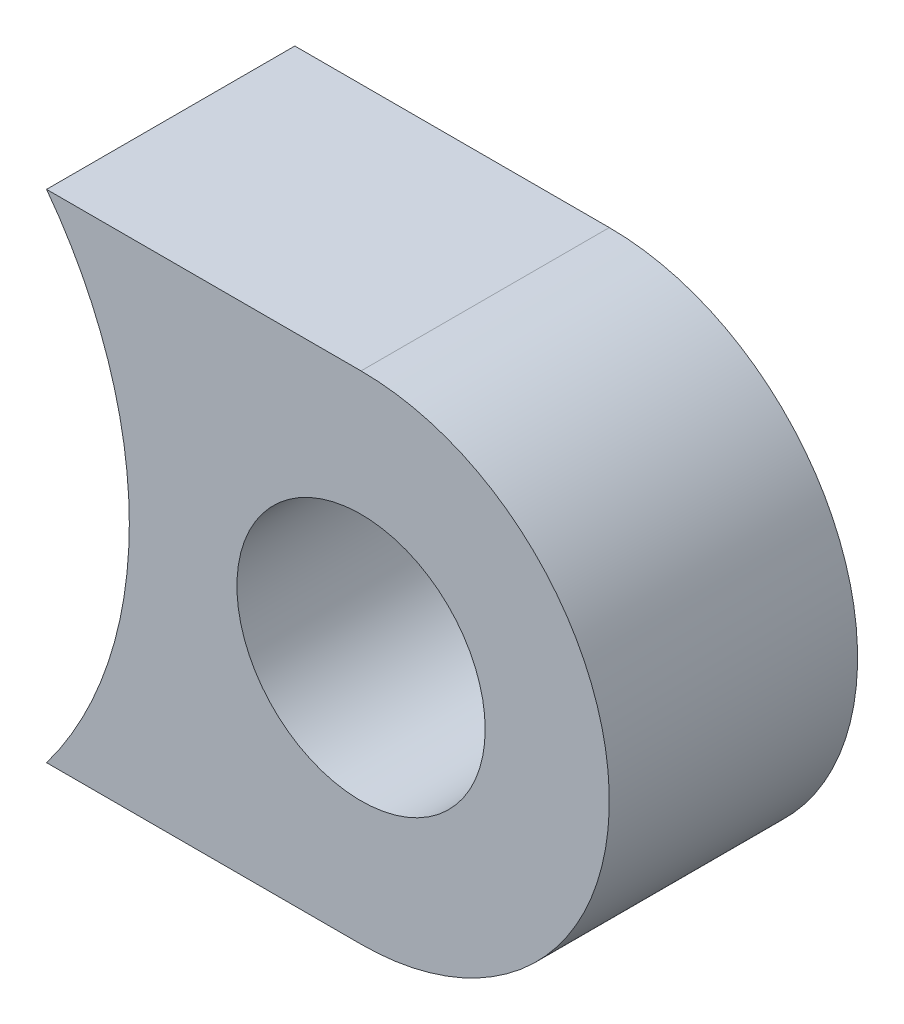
ISO-10303-21;
HEADER;
FILE_DESCRIPTION(('STEP AP214'),'2;1');
FILE_NAME('part.step','',(''),(''),'','','');
FILE_SCHEMA(('AUTOMOTIVE_DESIGN { 1 0 10303 214 1 1 1 1 }'));
ENDSEC;
DATA;
#1=APPLICATION_CONTEXT('core data for automotive mechanical design processes');
#2=APPLICATION_PROTOCOL_DEFINITION('international standard','automotive_design',2000,#1);
#3=PRODUCT_CONTEXT('',#1,'mechanical');
#4=PRODUCT('Part','Part','',(#3));
#5=PRODUCT_RELATED_PRODUCT_CATEGORY('part','',(#4));
#6=PRODUCT_DEFINITION_FORMATION('','',#4);
#7=PRODUCT_DEFINITION_CONTEXT('part definition',#1,'design');
#8=PRODUCT_DEFINITION('design','',#6,#7);
#9=PRODUCT_DEFINITION_SHAPE('','',#8);
#10=(LENGTH_UNIT() NAMED_UNIT(*) SI_UNIT(.MILLI.,.METRE.));
#11=(NAMED_UNIT(*) PLANE_ANGLE_UNIT() SI_UNIT($,.RADIAN.));
#12=(NAMED_UNIT(*) SI_UNIT($,.STERADIAN.) SOLID_ANGLE_UNIT());
#13=UNCERTAINTY_MEASURE_WITH_UNIT(LENGTH_MEASURE(1.E-05),#10,'distance_accuracy_value','');
#14=(GEOMETRIC_REPRESENTATION_CONTEXT(3) GLOBAL_UNCERTAINTY_ASSIGNED_CONTEXT((#13)) GLOBAL_UNIT_ASSIGNED_CONTEXT((#10,
#11,#12)) REPRESENTATION_CONTEXT('',''));
#15=CARTESIAN_POINT('',(0.,0.,0.));
#16=DIRECTION('',(0.,0.,1.));
#17=DIRECTION('',(1.,0.,0.));
#18=AXIS2_PLACEMENT_3D('',#15,#16,#17);
#19=CARTESIAN_POINT('',(0.,0.,30.));
#20=DIRECTION('',(0.,0.,-1.));
#21=DIRECTION('',(-1.,0.,0.));
#22=AXIS2_PLACEMENT_3D('',#19,#20,#21);
#23=CYLINDRICAL_SURFACE('',#22,50.);
#24=CARTESIAN_POINT('',(0.,0.,0.));
#25=DIRECTION('',(0.,0.,1.));
#26=DIRECTION('',(1.,0.,0.));
#27=AXIS2_PLACEMENT_3D('',#24,#25,#26);
#28=CIRCLE('',#27,50.);
#29=CARTESIAN_POINT('',(40.,-30.,0.));
#30=VERTEX_POINT('',#29);
#31=CARTESIAN_POINT('',(40.,30.,0.));
#32=VERTEX_POINT('',#31);
#33=EDGE_CURVE('E97',#30,#32,#28,.T.);
#34=ORIENTED_EDGE('',*,*,#33,.F.);
#35=DIRECTION('',(0.,0.,-1.));
#36=VECTOR('',#35,1.);
#37=CARTESIAN_POINT('',(40.,-30.,30.));
#38=LINE('',#37,#36);
#39=CARTESIAN_POINT('',(40.,-30.,30.));
#40=VERTEX_POINT('',#39);
#41=EDGE_CURVE('E11',#40,#30,#38,.T.);
#42=ORIENTED_EDGE('',*,*,#41,.F.);
#43=CARTESIAN_POINT('',(0.,0.,30.));
#44=DIRECTION('',(0.,0.,1.));
#45=DIRECTION('',(1.,0.,0.));
#46=AXIS2_PLACEMENT_3D('',#43,#44,#45);
#47=CIRCLE('',#46,50.);
#48=CARTESIAN_POINT('',(40.,30.,30.));
#49=VERTEX_POINT('',#48);
#50=EDGE_CURVE('E86',#40,#49,#47,.T.);
#51=ORIENTED_EDGE('',*,*,#50,.T.);
#52=DIRECTION('',(0.,0.,-1.));
#53=VECTOR('',#52,1.);
#54=CARTESIAN_POINT('',(40.,30.,30.));
#55=LINE('',#54,#53);
#56=EDGE_CURVE('E47',#49,#32,#55,.T.);
#57=ORIENTED_EDGE('',*,*,#56,.T.);
#58=EDGE_LOOP('',(#34,#42,#51,#57));
#59=FACE_BOUND('',#58,.T.);
#60=ADVANCED_FACE('F30',(#59),#23,.F.);
#61=CARTESIAN_POINT('',(29.,-30.,30.));
#62=DIRECTION('',(0.,-1.,0.));
#63=DIRECTION('',(0.,0.,-1.));
#64=AXIS2_PLACEMENT_3D('',#61,#62,#63);
#65=PLANE('',#64);
#66=DIRECTION('',(-1.,0.,0.));
#67=VECTOR('',#66,1.);
#68=CARTESIAN_POINT('',(29.,-30.,0.));
#69=LINE('',#68,#67);
#70=CARTESIAN_POINT('',(78.,-30.,0.));
#71=VERTEX_POINT('',#70);
#72=EDGE_CURVE('E77',#71,#30,#69,.T.);
#73=ORIENTED_EDGE('',*,*,#72,.F.);
#74=DIRECTION('',(0.,0.,-1.));
#75=VECTOR('',#74,1.);
#76=CARTESIAN_POINT('',(78.,-30.,30.));
#77=LINE('',#76,#75);
#78=CARTESIAN_POINT('',(78.,-30.,30.));
#79=VERTEX_POINT('',#78);
#80=EDGE_CURVE('E39',#79,#71,#77,.T.);
#81=ORIENTED_EDGE('',*,*,#80,.F.);
#82=DIRECTION('',(-1.,0.,0.));
#83=VECTOR('',#82,1.);
#84=CARTESIAN_POINT('',(29.,-30.,30.));
#85=LINE('',#84,#83);
#86=EDGE_CURVE('E75',#79,#40,#85,.T.);
#87=ORIENTED_EDGE('',*,*,#86,.T.);
#88=ORIENTED_EDGE('',*,*,#41,.T.);
#89=EDGE_LOOP('',(#73,#81,#87,#88));
#90=FACE_BOUND('',#89,.T.);
#91=ADVANCED_FACE('F74',(#90),#65,.T.);
#92=CARTESIAN_POINT('',(78.,0.,30.));
#93=DIRECTION('',(0.,0.,-1.));
#94=DIRECTION('',(-1.,0.,0.));
#95=AXIS2_PLACEMENT_3D('',#92,#93,#94);
#96=CYLINDRICAL_SURFACE('',#95,30.);
#97=CARTESIAN_POINT('',(78.,0.,0.));
#98=DIRECTION('',(0.,0.,1.));
#99=DIRECTION('',(1.,0.,0.));
#100=AXIS2_PLACEMENT_3D('',#97,#98,#99);
#101=CIRCLE('',#100,30.);
#102=CARTESIAN_POINT('',(78.,30.,0.));
#103=VERTEX_POINT('',#102);
#104=EDGE_CURVE('E100',#103,#71,#101,.F.);
#105=ORIENTED_EDGE('',*,*,#104,.F.);
#106=DIRECTION('',(0.,0.,-1.));
#107=VECTOR('',#106,1.);
#108=CARTESIAN_POINT('',(78.,30.,30.));
#109=LINE('',#108,#107);
#110=CARTESIAN_POINT('',(78.,30.,30.));
#111=VERTEX_POINT('',#110);
#112=EDGE_CURVE('E60',#111,#103,#109,.T.);
#113=ORIENTED_EDGE('',*,*,#112,.F.);
#114=CARTESIAN_POINT('',(78.,0.,30.));
#115=DIRECTION('',(0.,0.,1.));
#116=DIRECTION('',(1.,0.,0.));
#117=AXIS2_PLACEMENT_3D('',#114,#115,#116);
#118=CIRCLE('',#117,30.);
#119=EDGE_CURVE('E85',#111,#79,#118,.F.);
#120=ORIENTED_EDGE('',*,*,#119,.T.);
#121=ORIENTED_EDGE('',*,*,#80,.T.);
#122=EDGE_LOOP('',(#105,#113,#120,#121));
#123=FACE_BOUND('',#122,.T.);
#124=ADVANCED_FACE('F88',(#123),#96,.T.);
#125=CARTESIAN_POINT('',(78.,0.,30.));
#126=DIRECTION('',(0.,0.,-1.));
#127=DIRECTION('',(-1.,0.,0.));
#128=AXIS2_PLACEMENT_3D('',#125,#126,#127);
#129=CYLINDRICAL_SURFACE('',#128,15.);
#130=CARTESIAN_POINT('',(78.,0.,30.));
#131=DIRECTION('',(0.,0.,1.));
#132=DIRECTION('',(1.,0.,0.));
#133=AXIS2_PLACEMENT_3D('',#130,#131,#132);
#134=CIRCLE('',#133,15.);
#135=CARTESIAN_POINT('',(93.,0.,30.));
#136=VERTEX_POINT('',#135);
#137=EDGE_CURVE('E105',#136,#136,#134,.T.);
#138=ORIENTED_EDGE('',*,*,#137,.T.);
#139=EDGE_LOOP('',(#138));
#140=FACE_BOUND('',#139,.T.);
#141=CARTESIAN_POINT('',(78.,0.,0.));
#142=DIRECTION('',(0.,0.,1.));
#143=DIRECTION('',(1.,0.,0.));
#144=AXIS2_PLACEMENT_3D('',#141,#142,#143);
#145=CIRCLE('',#144,15.);
#146=CARTESIAN_POINT('',(93.,0.,0.));
#147=VERTEX_POINT('',#146);
#148=EDGE_CURVE('E94',#147,#147,#145,.T.);
#149=ORIENTED_EDGE('',*,*,#148,.F.);
#150=EDGE_LOOP('',(#149));
#151=FACE_BOUND('',#150,.T.);
#152=ADVANCED_FACE('F32',(#140,#151),#129,.F.);
#153=CARTESIAN_POINT('',(29.,30.,30.));
#154=DIRECTION('',(0.,1.,0.));
#155=DIRECTION('',(0.,0.,1.));
#156=AXIS2_PLACEMENT_3D('',#153,#154,#155);
#157=PLANE('',#156);
#158=DIRECTION('',(1.,0.,0.));
#159=VECTOR('',#158,1.);
#160=CARTESIAN_POINT('',(29.,30.,0.));
#161=LINE('',#160,#159);
#162=EDGE_CURVE('E102',#32,#103,#161,.T.);
#163=ORIENTED_EDGE('',*,*,#162,.F.);
#164=ORIENTED_EDGE('',*,*,#56,.F.);
#165=DIRECTION('',(1.,0.,0.));
#166=VECTOR('',#165,1.);
#167=CARTESIAN_POINT('',(29.,30.,30.));
#168=LINE('',#167,#166);
#169=EDGE_CURVE('E89',#49,#111,#168,.T.);
#170=ORIENTED_EDGE('',*,*,#169,.T.);
#171=ORIENTED_EDGE('',*,*,#112,.T.);
#172=EDGE_LOOP('',(#163,#164,#170,#171));
#173=FACE_BOUND('',#172,.T.);
#174=ADVANCED_FACE('F112',(#173),#157,.T.);
#175=CARTESIAN_POINT('',(29.,-145.58288724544,30.));
#176=DIRECTION('',(0.,0.,1.));
#177=DIRECTION('',(1.,0.,0.));
#178=AXIS2_PLACEMENT_3D('',#175,#176,#177);
#179=PLANE('',#178);
#180=ORIENTED_EDGE('',*,*,#137,.F.);
#181=EDGE_LOOP('',(#180));
#182=FACE_BOUND('',#181,.T.);
#183=ORIENTED_EDGE('',*,*,#50,.F.);
#184=ORIENTED_EDGE('',*,*,#86,.F.);
#185=ORIENTED_EDGE('',*,*,#119,.F.);
#186=ORIENTED_EDGE('',*,*,#169,.F.);
#187=EDGE_LOOP('',(#183,#184,#185,#186));
#188=FACE_BOUND('',#187,.T.);
#189=ADVANCED_FACE('F83',(#182,#188),#179,.T.);
#190=CARTESIAN_POINT('',(29.,-145.58288724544,0.));
#191=DIRECTION('',(0.,0.,1.));
#192=DIRECTION('',(1.,0.,0.));
#193=AXIS2_PLACEMENT_3D('',#190,#191,#192);
#194=PLANE('',#193);
#195=ORIENTED_EDGE('',*,*,#148,.T.);
#196=EDGE_LOOP('',(#195));
#197=FACE_BOUND('',#196,.T.);
#198=ORIENTED_EDGE('',*,*,#33,.T.);
#199=ORIENTED_EDGE('',*,*,#162,.T.);
#200=ORIENTED_EDGE('',*,*,#104,.T.);
#201=ORIENTED_EDGE('',*,*,#72,.T.);
#202=EDGE_LOOP('',(#198,#199,#200,#201));
#203=FACE_BOUND('',#202,.T.);
#204=ADVANCED_FACE('F119',(#197,#203),#194,.F.);
#205=CLOSED_SHELL('',(#60,#91,#124,#152,#174,#189,#204));
#206=MANIFOLD_SOLID_BREP('B2',#205);
#207=ADVANCED_BREP_SHAPE_REPRESENTATION('',(#18,#206),#14);
#208=SHAPE_DEFINITION_REPRESENTATION(#9,#207);
ENDSEC;
END-ISO-10303-21;
